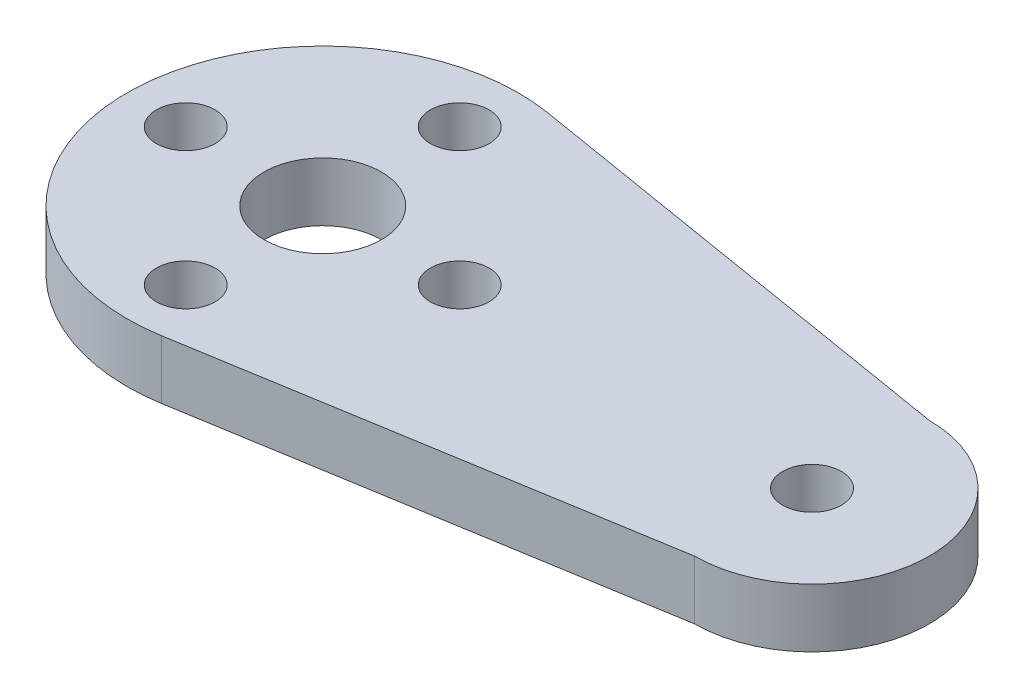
from build123d import *

# Parameters (mm, degrees)
SKETCH1_R           = 1.5
SKETCH1_R_2         = 3
BOSS_EXTRUDE1_DEPTH = 3


with BuildPart() as part:
    # Sketch1 → Boss-Extrude1 (new body)
    with BuildSketch(Plane(origin=(0, 0, 0), x_dir=(1, 0, 0), z_dir=(0, 1, 0))):
        with BuildLine():
            Line((25, 6), (1.632184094, 9.865899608))
            ThreePointArc((1.632184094, 9.865899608), (-10, 0), (1.632184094, -9.865899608))
            Line((1.632184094, -9.865899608), (25, -6))
            ThreePointArc((25, -6), (31, 0), (25, 6))
        make_face()
        with Locations(Location((25, 0, 0), (0, 0, 270))):
            Circle(SKETCH1_R, mode=Mode.SUBTRACT)
        with Locations(Location((-7, 0, 0), (0, 0, 270))):
            Circle(SKETCH1_R, mode=Mode.SUBTRACT)
        with Locations(Location((0, 0, 0), (0, 0, 270))):
            Circle(SKETCH1_R_2, mode=Mode.SUBTRACT)
        with Locations(Location((7, 0, 0), (0, 0, 270))):
            Circle(SKETCH1_R, mode=Mode.SUBTRACT)
        with Locations(Location((0, 7, 0), (0, 0, 270))):
            Circle(SKETCH1_R, mode=Mode.SUBTRACT)
        with Locations(Location((0, -7, 0), (0, 0, 270))):
            Circle(SKETCH1_R, mode=Mode.SUBTRACT)
    extrude(amount=BOSS_EXTRUDE1_DEPTH)


solid = part.part
